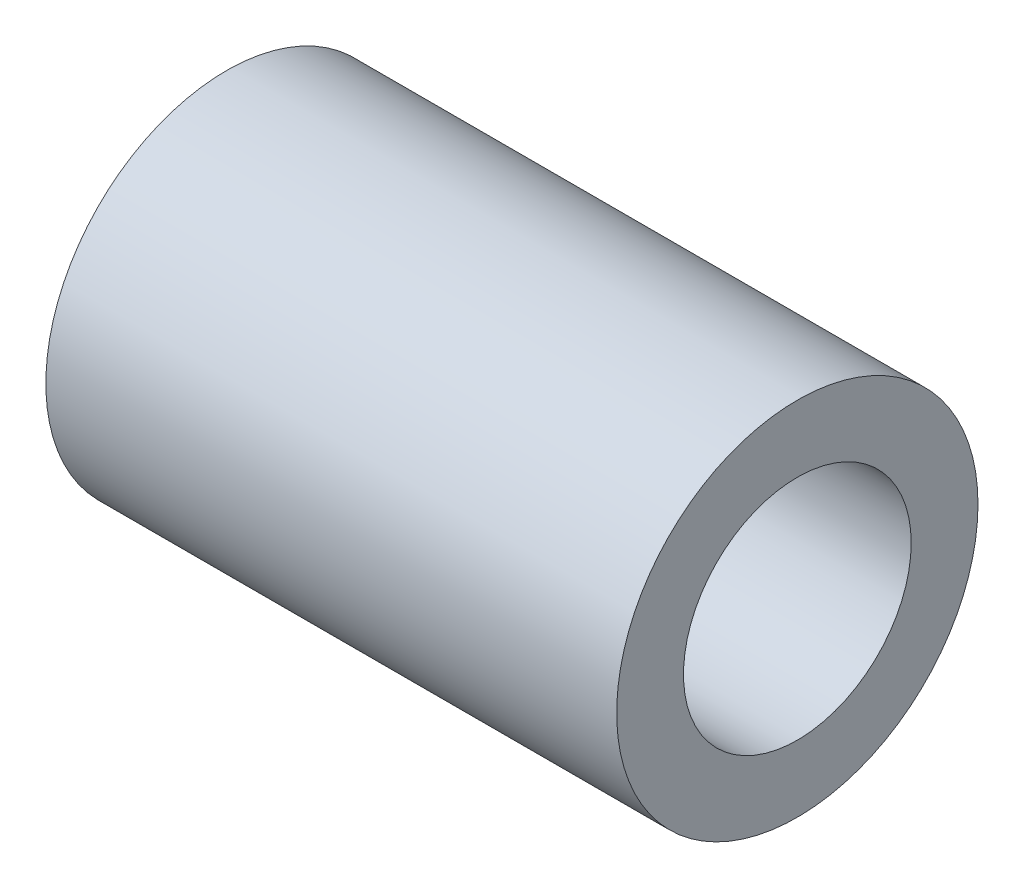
ISO-10303-21;
HEADER;
FILE_DESCRIPTION(('STEP AP214'),'2;1');
FILE_NAME('part.step','',(''),(''),'','','');
FILE_SCHEMA(('AUTOMOTIVE_DESIGN { 1 0 10303 214 1 1 1 1 }'));
ENDSEC;
DATA;
#1=APPLICATION_CONTEXT('core data for automotive mechanical design processes');
#2=APPLICATION_PROTOCOL_DEFINITION('international standard','automotive_design',2000,#1);
#3=PRODUCT_CONTEXT('',#1,'mechanical');
#4=PRODUCT('Part','Part','',(#3));
#5=PRODUCT_RELATED_PRODUCT_CATEGORY('part','',(#4));
#6=PRODUCT_DEFINITION_FORMATION('','',#4);
#7=PRODUCT_DEFINITION_CONTEXT('part definition',#1,'design');
#8=PRODUCT_DEFINITION('design','',#6,#7);
#9=PRODUCT_DEFINITION_SHAPE('','',#8);
#10=(LENGTH_UNIT() NAMED_UNIT(*) SI_UNIT(.MILLI.,.METRE.));
#11=(NAMED_UNIT(*) PLANE_ANGLE_UNIT() SI_UNIT($,.RADIAN.));
#12=(NAMED_UNIT(*) SI_UNIT($,.STERADIAN.) SOLID_ANGLE_UNIT());
#13=UNCERTAINTY_MEASURE_WITH_UNIT(LENGTH_MEASURE(1.E-05),#10,'distance_accuracy_value','');
#14=(GEOMETRIC_REPRESENTATION_CONTEXT(3) GLOBAL_UNCERTAINTY_ASSIGNED_CONTEXT((#13)) GLOBAL_UNIT_ASSIGNED_CONTEXT((#10,
#11,#12)) REPRESENTATION_CONTEXT('',''));
#15=CARTESIAN_POINT('',(0.,0.,0.));
#16=DIRECTION('',(0.,0.,1.));
#17=DIRECTION('',(1.,0.,0.));
#18=AXIS2_PLACEMENT_3D('',#15,#16,#17);
#19=CARTESIAN_POINT('',(23.876,0.,0.));
#20=DIRECTION('',(1.,0.,0.));
#21=DIRECTION('',(0.,0.,-1.));
#22=AXIS2_PLACEMENT_3D('',#19,#20,#21);
#23=PLANE('',#22);
#24=CARTESIAN_POINT('',(23.876,0.,0.));
#25=DIRECTION('',(1.,0.,0.));
#26=DIRECTION('',(0.,0.,-1.));
#27=AXIS2_PLACEMENT_3D('',#24,#25,#26);
#28=CIRCLE('',#27,15.113);
#29=CARTESIAN_POINT('',(23.876,0.,-15.113));
#30=VERTEX_POINT('',#29);
#31=EDGE_CURVE('E12',#30,#30,#28,.T.);
#32=ORIENTED_EDGE('',*,*,#31,.T.);
#33=EDGE_LOOP('',(#32));
#34=FACE_BOUND('',#33,.T.);
#35=CARTESIAN_POINT('',(23.876,0.,0.));
#36=DIRECTION('',(1.,0.,0.));
#37=DIRECTION('',(0.,0.,-1.));
#38=AXIS2_PLACEMENT_3D('',#35,#36,#37);
#39=CIRCLE('',#38,9.525);
#40=CARTESIAN_POINT('',(23.876,0.,-9.525));
#41=VERTEX_POINT('',#40);
#42=EDGE_CURVE('E411',#41,#41,#39,.T.);
#43=ORIENTED_EDGE('',*,*,#42,.F.);
#44=EDGE_LOOP('',(#43));
#45=FACE_BOUND('',#44,.T.);
#46=ADVANCED_FACE('F400',(#34,#45),#23,.T.);
#47=CARTESIAN_POINT('',(-23.876,0.,0.));
#48=DIRECTION('',(1.,0.,0.));
#49=DIRECTION('',(0.,0.,-1.));
#50=AXIS2_PLACEMENT_3D('',#47,#48,#49);
#51=PLANE('',#50);
#52=CARTESIAN_POINT('',(-23.876,0.,0.));
#53=DIRECTION('',(1.,0.,0.));
#54=DIRECTION('',(0.,0.,-1.));
#55=AXIS2_PLACEMENT_3D('',#52,#53,#54);
#56=CIRCLE('',#55,15.113);
#57=CARTESIAN_POINT('',(-23.876,0.,-15.113));
#58=VERTEX_POINT('',#57);
#59=EDGE_CURVE('E407',#58,#58,#56,.T.);
#60=ORIENTED_EDGE('',*,*,#59,.F.);
#61=EDGE_LOOP('',(#60));
#62=FACE_BOUND('',#61,.T.);
#63=CARTESIAN_POINT('',(-23.876,0.,0.));
#64=DIRECTION('',(1.,0.,0.));
#65=DIRECTION('',(0.,0.,-1.));
#66=AXIS2_PLACEMENT_3D('',#63,#64,#65);
#67=CIRCLE('',#66,9.525);
#68=CARTESIAN_POINT('',(-23.876,0.,-9.525));
#69=VERTEX_POINT('',#68);
#70=EDGE_CURVE('E415',#69,#69,#67,.T.);
#71=ORIENTED_EDGE('',*,*,#70,.T.);
#72=EDGE_LOOP('',(#71));
#73=FACE_BOUND('',#72,.T.);
#74=ADVANCED_FACE('F421',(#62,#73),#51,.F.);
#75=CARTESIAN_POINT('',(23.876,0.,0.));
#76=DIRECTION('',(-1.,0.,0.));
#77=DIRECTION('',(0.,0.,1.));
#78=AXIS2_PLACEMENT_3D('',#75,#76,#77);
#79=CYLINDRICAL_SURFACE('',#78,15.113);
#80=ORIENTED_EDGE('',*,*,#31,.F.);
#81=EDGE_LOOP('',(#80));
#82=FACE_BOUND('',#81,.T.);
#83=ORIENTED_EDGE('',*,*,#59,.T.);
#84=EDGE_LOOP('',(#83));
#85=FACE_BOUND('',#84,.T.);
#86=ADVANCED_FACE('F402',(#82,#85),#79,.T.);
#87=CARTESIAN_POINT('',(23.876,0.,0.));
#88=DIRECTION('',(-1.,0.,0.));
#89=DIRECTION('',(0.,0.,1.));
#90=AXIS2_PLACEMENT_3D('',#87,#88,#89);
#91=CYLINDRICAL_SURFACE('',#90,9.525);
#92=ORIENTED_EDGE('',*,*,#42,.T.);
#93=EDGE_LOOP('',(#92));
#94=FACE_BOUND('',#93,.T.);
#95=ORIENTED_EDGE('',*,*,#70,.F.);
#96=EDGE_LOOP('',(#95));
#97=FACE_BOUND('',#96,.T.);
#98=ADVANCED_FACE('F423',(#94,#97),#91,.F.);
#99=CLOSED_SHELL('',(#46,#74,#86,#98));
#100=MANIFOLD_SOLID_BREP('B2',#99);
#101=ADVANCED_BREP_SHAPE_REPRESENTATION('',(#18,#100),#14);
#102=SHAPE_DEFINITION_REPRESENTATION(#9,#101);
ENDSEC;
END-ISO-10303-21;
